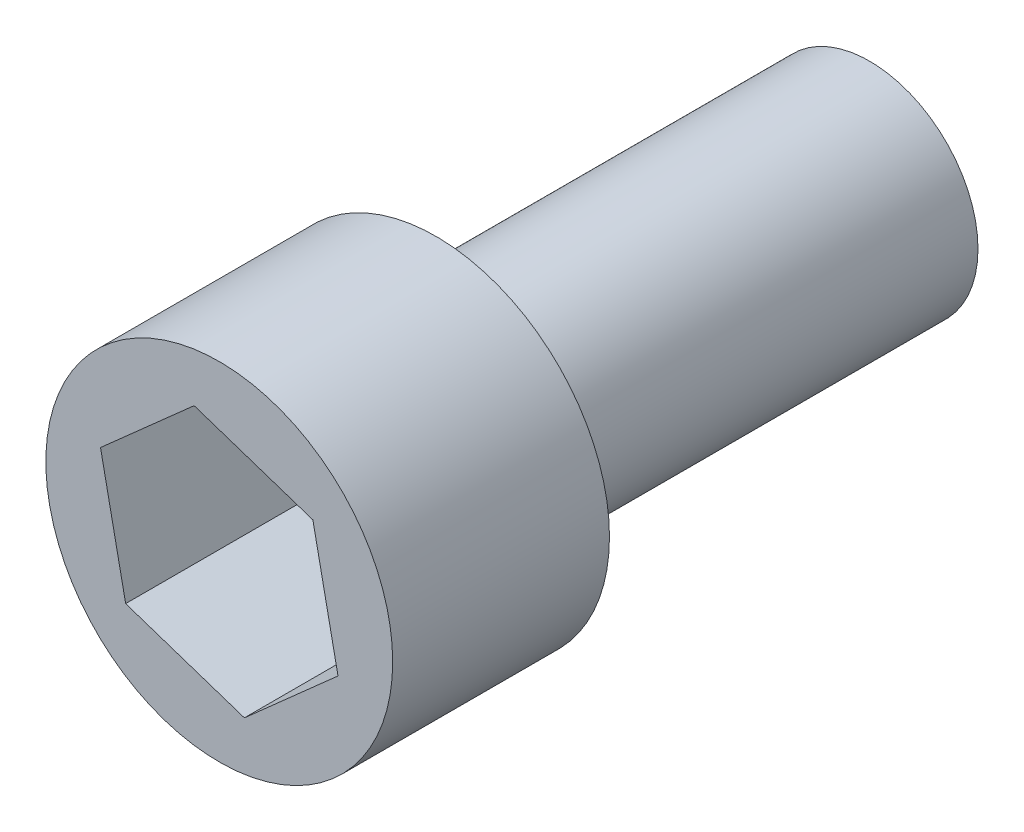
ISO-10303-21;
HEADER;
FILE_DESCRIPTION(('STEP AP214'),'2;1');
FILE_NAME('part.step','',(''),(''),'','','');
FILE_SCHEMA(('AUTOMOTIVE_DESIGN { 1 0 10303 214 1 1 1 1 }'));
ENDSEC;
DATA;
#1=APPLICATION_CONTEXT('core data for automotive mechanical design processes');
#2=APPLICATION_PROTOCOL_DEFINITION('international standard','automotive_design',2000,#1);
#3=PRODUCT_CONTEXT('',#1,'mechanical');
#4=PRODUCT('Part','Part','',(#3));
#5=PRODUCT_RELATED_PRODUCT_CATEGORY('part','',(#4));
#6=PRODUCT_DEFINITION_FORMATION('','',#4);
#7=PRODUCT_DEFINITION_CONTEXT('part definition',#1,'design');
#8=PRODUCT_DEFINITION('design','',#6,#7);
#9=PRODUCT_DEFINITION_SHAPE('','',#8);
#10=(LENGTH_UNIT() NAMED_UNIT(*) SI_UNIT(.MILLI.,.METRE.));
#11=(NAMED_UNIT(*) PLANE_ANGLE_UNIT() SI_UNIT($,.RADIAN.));
#12=(NAMED_UNIT(*) SI_UNIT($,.STERADIAN.) SOLID_ANGLE_UNIT());
#13=UNCERTAINTY_MEASURE_WITH_UNIT(LENGTH_MEASURE(1.E-05),#10,'distance_accuracy_value','');
#14=(GEOMETRIC_REPRESENTATION_CONTEXT(3) GLOBAL_UNCERTAINTY_ASSIGNED_CONTEXT((#13)) GLOBAL_UNIT_ASSIGNED_CONTEXT((#10,
#11,#12)) REPRESENTATION_CONTEXT('',''));
#15=CARTESIAN_POINT('',(0.,0.,0.));
#16=DIRECTION('',(0.,0.,1.));
#17=DIRECTION('',(1.,0.,0.));
#18=AXIS2_PLACEMENT_3D('',#15,#16,#17);
#19=CARTESIAN_POINT('',(0.,0.,20.));
#20=DIRECTION('',(0.,0.,-1.));
#21=DIRECTION('',(-1.,0.,0.));
#22=AXIS2_PLACEMENT_3D('',#19,#20,#21);
#23=CYLINDRICAL_SURFACE('',#22,5.);
#24=CARTESIAN_POINT('',(0.,0.,20.));
#25=DIRECTION('',(0.,0.,1.));
#26=DIRECTION('',(1.,0.,0.));
#27=AXIS2_PLACEMENT_3D('',#24,#25,#26);
#28=CIRCLE('',#27,5.);
#29=CARTESIAN_POINT('',(5.,0.,20.));
#30=VERTEX_POINT('',#29);
#31=EDGE_CURVE('E11',#30,#30,#28,.T.);
#32=ORIENTED_EDGE('',*,*,#31,.F.);
#33=EDGE_LOOP('',(#32));
#34=FACE_BOUND('',#33,.T.);
#35=CARTESIAN_POINT('',(0.,0.,0.));
#36=DIRECTION('',(0.,0.,1.));
#37=DIRECTION('',(1.,0.,0.));
#38=AXIS2_PLACEMENT_3D('',#35,#36,#37);
#39=CIRCLE('',#38,5.);
#40=CARTESIAN_POINT('',(5.,0.,0.));
#41=VERTEX_POINT('',#40);
#42=EDGE_CURVE('E35',#41,#41,#39,.T.);
#43=ORIENTED_EDGE('',*,*,#42,.T.);
#44=EDGE_LOOP('',(#43));
#45=FACE_BOUND('',#44,.T.);
#46=ADVANCED_FACE('F32',(#34,#45),#23,.T.);
#47=CARTESIAN_POINT('',(0.,0.,0.));
#48=DIRECTION('',(0.,0.,1.));
#49=DIRECTION('',(1.,0.,0.));
#50=AXIS2_PLACEMENT_3D('',#47,#48,#49);
#51=PLANE('',#50);
#52=ORIENTED_EDGE('',*,*,#42,.F.);
#53=EDGE_LOOP('',(#52));
#54=FACE_BOUND('',#53,.T.);
#55=ADVANCED_FACE('F150',(#54),#51,.F.);
#56=CARTESIAN_POINT('',(0.,0.,20.));
#57=DIRECTION('',(0.,0.,1.));
#58=DIRECTION('',(1.,0.,0.));
#59=AXIS2_PLACEMENT_3D('',#56,#57,#58);
#60=PLANE('',#59);
#61=CARTESIAN_POINT('',(0.,0.,20.));
#62=DIRECTION('',(0.,0.,1.));
#63=DIRECTION('',(1.,0.,0.));
#64=AXIS2_PLACEMENT_3D('',#61,#62,#63);
#65=CIRCLE('',#64,8.);
#66=CARTESIAN_POINT('',(8.,0.,20.));
#67=VERTEX_POINT('',#66);
#68=EDGE_CURVE('E133',#67,#67,#65,.T.);
#69=ORIENTED_EDGE('',*,*,#68,.F.);
#70=EDGE_LOOP('',(#69));
#71=FACE_BOUND('',#70,.T.);
#72=ORIENTED_EDGE('',*,*,#31,.T.);
#73=EDGE_LOOP('',(#72));
#74=FACE_BOUND('',#73,.T.);
#75=ADVANCED_FACE('F147',(#71,#74),#60,.F.);
#76=CARTESIAN_POINT('',(0.,0.,30.));
#77=DIRECTION('',(0.,0.,-1.));
#78=DIRECTION('',(-1.,0.,0.));
#79=AXIS2_PLACEMENT_3D('',#76,#77,#78);
#80=CYLINDRICAL_SURFACE('',#79,8.);
#81=CARTESIAN_POINT('',(0.,0.,30.));
#82=DIRECTION('',(0.,0.,1.));
#83=DIRECTION('',(1.,0.,0.));
#84=AXIS2_PLACEMENT_3D('',#81,#82,#83);
#85=CIRCLE('',#84,8.);
#86=CARTESIAN_POINT('',(8.,0.,30.));
#87=VERTEX_POINT('',#86);
#88=EDGE_CURVE('E139',#87,#87,#85,.T.);
#89=ORIENTED_EDGE('',*,*,#88,.F.);
#90=EDGE_LOOP('',(#89));
#91=FACE_BOUND('',#90,.T.);
#92=ORIENTED_EDGE('',*,*,#68,.T.);
#93=EDGE_LOOP('',(#92));
#94=FACE_BOUND('',#93,.T.);
#95=ADVANCED_FACE('F145',(#91,#94),#80,.T.);
#96=CARTESIAN_POINT('',(0.,0.,30.));
#97=DIRECTION('',(0.,0.,1.));
#98=DIRECTION('',(1.,0.,0.));
#99=AXIS2_PLACEMENT_3D('',#96,#97,#98);
#100=PLANE('',#99);
#101=DIRECTION('',(-0.948786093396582,0.315919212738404,0.));
#102=VECTOR('',#101,1.);
#103=CARTESIAN_POINT('',(4.31850559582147,3.83195025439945,30.));
#104=LINE('',#103,#102);
#105=CARTESIAN_POINT('',(4.31850559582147,3.83195025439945,30.));
#106=VERTEX_POINT('',#105);
#107=CARTESIAN_POINT('',(-1.15931346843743,5.65591067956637,30.));
#108=VERTEX_POINT('',#107);
#109=EDGE_CURVE('E46',#106,#108,#104,.T.);
#110=ORIENTED_EDGE('',*,*,#109,.F.);
#111=DIRECTION('',(-0.200798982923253,0.979632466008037,0.));
#112=VECTOR('',#111,1.);
#113=CARTESIAN_POINT('',(5.4778190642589,-1.82396042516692,30.));
#114=LINE('',#113,#112);
#115=CARTESIAN_POINT('',(5.4778190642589,-1.82396042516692,30.));
#116=VERTEX_POINT('',#115);
#117=EDGE_CURVE('E129',#116,#106,#114,.T.);
#118=ORIENTED_EDGE('',*,*,#117,.F.);
#119=DIRECTION('',(0.747987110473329,0.663713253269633,0.));
#120=VECTOR('',#119,1.);
#121=CARTESIAN_POINT('',(1.15931346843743,-5.65591067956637,30.));
#122=LINE('',#121,#120);
#123=CARTESIAN_POINT('',(1.15931346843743,-5.65591067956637,30.));
#124=VERTEX_POINT('',#123);
#125=EDGE_CURVE('E127',#124,#116,#122,.T.);
#126=ORIENTED_EDGE('',*,*,#125,.F.);
#127=DIRECTION('',(0.948786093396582,-0.315919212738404,0.));
#128=VECTOR('',#127,1.);
#129=CARTESIAN_POINT('',(-4.31850559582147,-3.83195025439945,30.));
#130=LINE('',#129,#128);
#131=CARTESIAN_POINT('',(-4.31850559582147,-3.83195025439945,30.));
#132=VERTEX_POINT('',#131);
#133=EDGE_CURVE('E94',#132,#124,#130,.T.);
#134=ORIENTED_EDGE('',*,*,#133,.F.);
#135=DIRECTION('',(0.200798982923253,-0.979632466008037,0.));
#136=VECTOR('',#135,1.);
#137=CARTESIAN_POINT('',(-5.4778190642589,1.82396042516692,30.));
#138=LINE('',#137,#136);
#139=CARTESIAN_POINT('',(-5.4778190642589,1.82396042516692,30.));
#140=VERTEX_POINT('',#139);
#141=EDGE_CURVE('E123',#140,#132,#138,.T.);
#142=ORIENTED_EDGE('',*,*,#141,.F.);
#143=DIRECTION('',(-0.747987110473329,-0.663713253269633,0.));
#144=VECTOR('',#143,1.);
#145=CARTESIAN_POINT('',(-1.15931346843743,5.65591067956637,30.));
#146=LINE('',#145,#144);
#147=EDGE_CURVE('E120',#108,#140,#146,.T.);
#148=ORIENTED_EDGE('',*,*,#147,.F.);
#149=EDGE_LOOP('',(#110,#118,#126,#134,#142,#148));
#150=FACE_BOUND('',#149,.T.);
#151=ORIENTED_EDGE('',*,*,#88,.T.);
#152=EDGE_LOOP('',(#151));
#153=FACE_BOUND('',#152,.T.);
#154=ADVANCED_FACE('F164',(#150,#153),#100,.T.);
#155=CARTESIAN_POINT('',(4.31850559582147,3.83195025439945,20.5));
#156=DIRECTION('',(0.315919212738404,0.948786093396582,0.));
#157=DIRECTION('',(-0.948786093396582,0.315919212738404,0.));
#158=AXIS2_PLACEMENT_3D('',#155,#156,#157);
#159=PLANE('',#158);
#160=ORIENTED_EDGE('',*,*,#109,.T.);
#161=DIRECTION('',(0.,0.,1.));
#162=VECTOR('',#161,1.);
#163=CARTESIAN_POINT('',(-1.15931346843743,5.65591067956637,20.5));
#164=LINE('',#163,#162);
#165=CARTESIAN_POINT('',(-1.15931346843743,5.65591067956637,20.5));
#166=VERTEX_POINT('',#165);
#167=EDGE_CURVE('E76',#166,#108,#164,.T.);
#168=ORIENTED_EDGE('',*,*,#167,.F.);
#169=DIRECTION('',(-0.948786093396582,0.315919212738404,0.));
#170=VECTOR('',#169,1.);
#171=CARTESIAN_POINT('',(4.31850559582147,3.83195025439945,20.5));
#172=LINE('',#171,#170);
#173=CARTESIAN_POINT('',(4.31850559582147,3.83195025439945,20.5));
#174=VERTEX_POINT('',#173);
#175=EDGE_CURVE('E131',#174,#166,#172,.T.);
#176=ORIENTED_EDGE('',*,*,#175,.F.);
#177=DIRECTION('',(0.,0.,1.));
#178=VECTOR('',#177,1.);
#179=CARTESIAN_POINT('',(4.31850559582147,3.83195025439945,20.5));
#180=LINE('',#179,#178);
#181=EDGE_CURVE('E54',#174,#106,#180,.T.);
#182=ORIENTED_EDGE('',*,*,#181,.T.);
#183=EDGE_LOOP('',(#160,#168,#176,#182));
#184=FACE_BOUND('',#183,.T.);
#185=ADVANCED_FACE('F169',(#184),#159,.F.);
#186=CARTESIAN_POINT('',(5.4778190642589,-1.82396042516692,20.5));
#187=DIRECTION('',(0.979632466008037,0.200798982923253,0.));
#188=DIRECTION('',(-0.200798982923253,0.979632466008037,0.));
#189=AXIS2_PLACEMENT_3D('',#186,#187,#188);
#190=PLANE('',#189);
#191=ORIENTED_EDGE('',*,*,#117,.T.);
#192=ORIENTED_EDGE('',*,*,#181,.F.);
#193=DIRECTION('',(-0.200798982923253,0.979632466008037,0.));
#194=VECTOR('',#193,1.);
#195=CARTESIAN_POINT('',(5.4778190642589,-1.82396042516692,20.5));
#196=LINE('',#195,#194);
#197=CARTESIAN_POINT('',(5.4778190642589,-1.82396042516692,20.5));
#198=VERTEX_POINT('',#197);
#199=EDGE_CURVE('E106',#198,#174,#196,.T.);
#200=ORIENTED_EDGE('',*,*,#199,.F.);
#201=DIRECTION('',(0.,0.,1.));
#202=VECTOR('',#201,1.);
#203=CARTESIAN_POINT('',(5.4778190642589,-1.82396042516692,20.5));
#204=LINE('',#203,#202);
#205=EDGE_CURVE('E98',#198,#116,#204,.T.);
#206=ORIENTED_EDGE('',*,*,#205,.T.);
#207=EDGE_LOOP('',(#191,#192,#200,#206));
#208=FACE_BOUND('',#207,.T.);
#209=ADVANCED_FACE('F173',(#208),#190,.F.);
#210=CARTESIAN_POINT('',(1.15931346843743,-5.65591067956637,20.5));
#211=DIRECTION('',(0.663713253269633,-0.747987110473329,0.));
#212=DIRECTION('',(0.747987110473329,0.663713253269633,0.));
#213=AXIS2_PLACEMENT_3D('',#210,#211,#212);
#214=PLANE('',#213);
#215=ORIENTED_EDGE('',*,*,#125,.T.);
#216=ORIENTED_EDGE('',*,*,#205,.F.);
#217=DIRECTION('',(0.747987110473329,0.663713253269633,0.));
#218=VECTOR('',#217,1.);
#219=CARTESIAN_POINT('',(1.15931346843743,-5.65591067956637,20.5));
#220=LINE('',#219,#218);
#221=CARTESIAN_POINT('',(1.15931346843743,-5.65591067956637,20.5));
#222=VERTEX_POINT('',#221);
#223=EDGE_CURVE('E102',#222,#198,#220,.T.);
#224=ORIENTED_EDGE('',*,*,#223,.F.);
#225=DIRECTION('',(0.,0.,1.));
#226=VECTOR('',#225,1.);
#227=CARTESIAN_POINT('',(1.15931346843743,-5.65591067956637,20.5));
#228=LINE('',#227,#226);
#229=EDGE_CURVE('E87',#222,#124,#228,.T.);
#230=ORIENTED_EDGE('',*,*,#229,.T.);
#231=EDGE_LOOP('',(#215,#216,#224,#230));
#232=FACE_BOUND('',#231,.T.);
#233=ADVANCED_FACE('F103',(#232),#214,.F.);
#234=CARTESIAN_POINT('',(-4.31850559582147,-3.83195025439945,20.5));
#235=DIRECTION('',(-0.315919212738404,-0.948786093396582,0.));
#236=DIRECTION('',(0.948786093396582,-0.315919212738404,0.));
#237=AXIS2_PLACEMENT_3D('',#234,#235,#236);
#238=PLANE('',#237);
#239=ORIENTED_EDGE('',*,*,#133,.T.);
#240=ORIENTED_EDGE('',*,*,#229,.F.);
#241=DIRECTION('',(0.948786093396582,-0.315919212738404,0.));
#242=VECTOR('',#241,1.);
#243=CARTESIAN_POINT('',(-4.31850559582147,-3.83195025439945,20.5));
#244=LINE('',#243,#242);
#245=CARTESIAN_POINT('',(-4.31850559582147,-3.83195025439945,20.5));
#246=VERTEX_POINT('',#245);
#247=EDGE_CURVE('E91',#246,#222,#244,.T.);
#248=ORIENTED_EDGE('',*,*,#247,.F.);
#249=DIRECTION('',(0.,0.,1.));
#250=VECTOR('',#249,1.);
#251=CARTESIAN_POINT('',(-4.31850559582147,-3.83195025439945,20.5));
#252=LINE('',#251,#250);
#253=EDGE_CURVE('E99',#246,#132,#252,.T.);
#254=ORIENTED_EDGE('',*,*,#253,.T.);
#255=EDGE_LOOP('',(#239,#240,#248,#254));
#256=FACE_BOUND('',#255,.T.);
#257=ADVANCED_FACE('F89',(#256),#238,.F.);
#258=CARTESIAN_POINT('',(-5.4778190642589,1.82396042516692,20.5));
#259=DIRECTION('',(-0.979632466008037,-0.200798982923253,0.));
#260=DIRECTION('',(0.200798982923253,-0.979632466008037,0.));
#261=AXIS2_PLACEMENT_3D('',#258,#259,#260);
#262=PLANE('',#261);
#263=ORIENTED_EDGE('',*,*,#141,.T.);
#264=ORIENTED_EDGE('',*,*,#253,.F.);
#265=DIRECTION('',(0.200798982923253,-0.979632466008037,0.));
#266=VECTOR('',#265,1.);
#267=CARTESIAN_POINT('',(-5.4778190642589,1.82396042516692,20.5));
#268=LINE('',#267,#266);
#269=CARTESIAN_POINT('',(-5.4778190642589,1.82396042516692,20.5));
#270=VERTEX_POINT('',#269);
#271=EDGE_CURVE('E112',#270,#246,#268,.T.);
#272=ORIENTED_EDGE('',*,*,#271,.F.);
#273=DIRECTION('',(0.,0.,1.));
#274=VECTOR('',#273,1.);
#275=CARTESIAN_POINT('',(-5.4778190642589,1.82396042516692,20.5));
#276=LINE('',#275,#274);
#277=EDGE_CURVE('E136',#270,#140,#276,.T.);
#278=ORIENTED_EDGE('',*,*,#277,.T.);
#279=EDGE_LOOP('',(#263,#264,#272,#278));
#280=FACE_BOUND('',#279,.T.);
#281=ADVANCED_FACE('F177',(#280),#262,.F.);
#282=CARTESIAN_POINT('',(-1.15931346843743,5.65591067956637,20.5));
#283=DIRECTION('',(-0.663713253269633,0.747987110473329,0.));
#284=DIRECTION('',(-0.747987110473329,-0.663713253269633,0.));
#285=AXIS2_PLACEMENT_3D('',#282,#283,#284);
#286=PLANE('',#285);
#287=ORIENTED_EDGE('',*,*,#147,.T.);
#288=ORIENTED_EDGE('',*,*,#277,.F.);
#289=DIRECTION('',(-0.747987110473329,-0.663713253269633,0.));
#290=VECTOR('',#289,1.);
#291=CARTESIAN_POINT('',(-1.15931346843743,5.65591067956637,20.5));
#292=LINE('',#291,#290);
#293=EDGE_CURVE('E114',#166,#270,#292,.T.);
#294=ORIENTED_EDGE('',*,*,#293,.F.);
#295=ORIENTED_EDGE('',*,*,#167,.T.);
#296=EDGE_LOOP('',(#287,#288,#294,#295));
#297=FACE_BOUND('',#296,.T.);
#298=ADVANCED_FACE('F174',(#297),#286,.F.);
#299=CARTESIAN_POINT('',(-1.15931346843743,5.65591067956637,20.5));
#300=DIRECTION('',(0.,0.,1.));
#301=DIRECTION('',(1.,0.,0.));
#302=AXIS2_PLACEMENT_3D('',#299,#300,#301);
#303=PLANE('',#302);
#304=ORIENTED_EDGE('',*,*,#175,.T.);
#305=ORIENTED_EDGE('',*,*,#293,.T.);
#306=ORIENTED_EDGE('',*,*,#271,.T.);
#307=ORIENTED_EDGE('',*,*,#247,.T.);
#308=ORIENTED_EDGE('',*,*,#223,.T.);
#309=ORIENTED_EDGE('',*,*,#199,.T.);
#310=EDGE_LOOP('',(#304,#305,#306,#307,#308,#309));
#311=FACE_BOUND('',#310,.T.);
#312=ADVANCED_FACE('F109',(#311),#303,.T.);
#313=CLOSED_SHELL('',(#46,#55,#75,#95,#154,#185,#209,#233,#257,#281,#298,#312));
#314=MANIFOLD_SOLID_BREP('B2',#313);
#315=ADVANCED_BREP_SHAPE_REPRESENTATION('',(#18,#314),#14);
#316=SHAPE_DEFINITION_REPRESENTATION(#9,#315);
ENDSEC;
END-ISO-10303-21;
